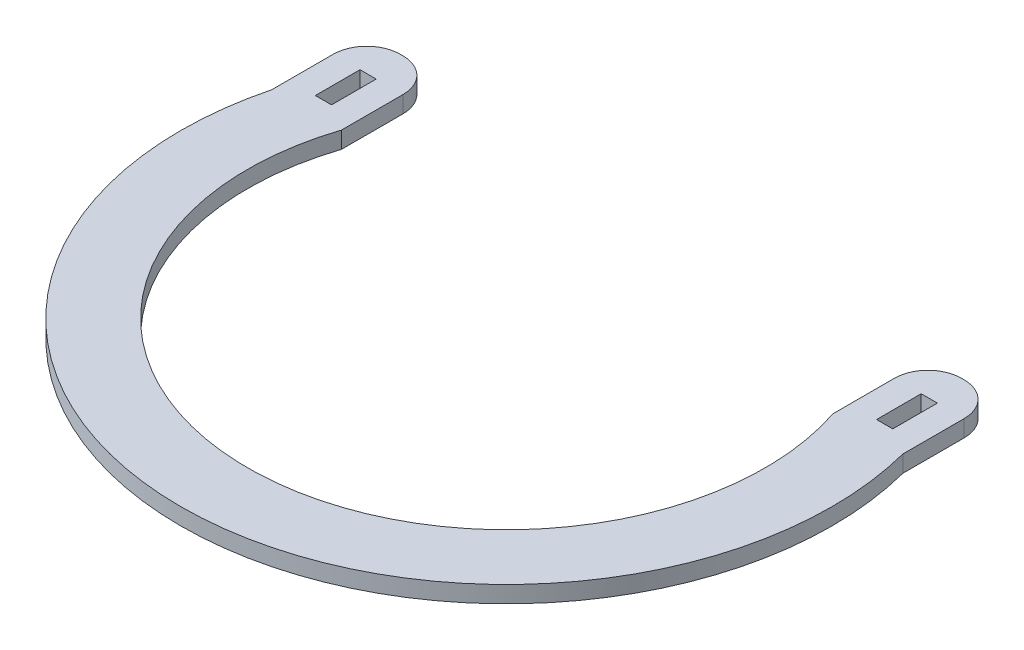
from build123d import *

# Parameters (mm, degrees)
ESQUISSE1_W        = 2.9
ESQUISSE1_H        = 8
BOSS_EXTRU_1_DEPTH = 3


with BuildPart() as part:
    # Esquisse1 → Boss.-Extru.1 (new body)
    with BuildSketch(Plane(origin=(0, 0, 0), x_dir=(1, 0, 0), z_dir=(0, 1, 0))):
        with BuildLine():
            Line((50.495519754, 17), (50, 17))
            ThreePointArc((50, 17), (45.757359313, 15.242640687), (44, 11))
            Line((44, 11), (44, 0))
            ThreePointArc((44, 0), (0, -60.806733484), (-44, 0))
            Line((-44, 0), (-44, 11))
            ThreePointArc((-44, 11), (-45.757359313, 15.242640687), (-50, 17))
            Line((-50, 17), (-50.495519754, 17))
            ThreePointArc((-50.495519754, 17), (-54.738160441, 15.242640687), (-56.495519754, 11))
            Line((-56.495519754, 11), (-56.495519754, 0))
            ThreePointArc((-56.495519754, 0), (0, -72.806733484), (56.495519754, 0))
            Line((56.495519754, 0), (56.495519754, 11))
            ThreePointArc((56.495519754, 11), (54.738160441, 15.242640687), (50.495519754, 17))
        make_face()
        with Locations((50.247759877, 7)):
            Rectangle(ESQUISSE1_W, ESQUISSE1_H, mode=Mode.SUBTRACT)
        with Locations((-50.247759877, 7)):
            Rectangle(ESQUISSE1_W, ESQUISSE1_H, mode=Mode.SUBTRACT)
    extrude(amount=BOSS_EXTRU_1_DEPTH)


solid = part.part
